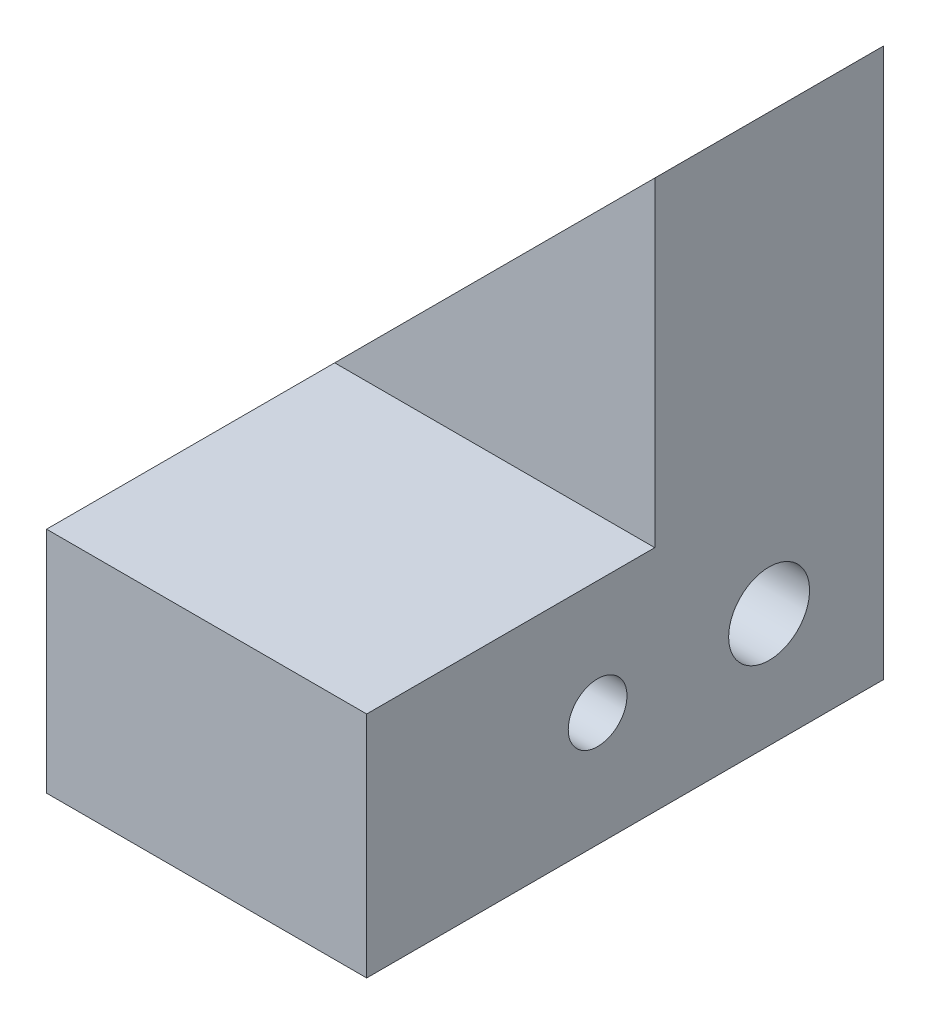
ISO-10303-21;
HEADER;
FILE_DESCRIPTION(('STEP AP214'),'2;1');
FILE_NAME('part.step','',(''),(''),'','','');
FILE_SCHEMA(('AUTOMOTIVE_DESIGN { 1 0 10303 214 1 1 1 1 }'));
ENDSEC;
DATA;
#1=APPLICATION_CONTEXT('core data for automotive mechanical design processes');
#2=APPLICATION_PROTOCOL_DEFINITION('international standard','automotive_design',2000,#1);
#3=PRODUCT_CONTEXT('',#1,'mechanical');
#4=PRODUCT('Part','Part','',(#3));
#5=PRODUCT_RELATED_PRODUCT_CATEGORY('part','',(#4));
#6=PRODUCT_DEFINITION_FORMATION('','',#4);
#7=PRODUCT_DEFINITION_CONTEXT('part definition',#1,'design');
#8=PRODUCT_DEFINITION('design','',#6,#7);
#9=PRODUCT_DEFINITION_SHAPE('','',#8);
#10=(LENGTH_UNIT() NAMED_UNIT(*) SI_UNIT(.MILLI.,.METRE.));
#11=(NAMED_UNIT(*) PLANE_ANGLE_UNIT() SI_UNIT($,.RADIAN.));
#12=(NAMED_UNIT(*) SI_UNIT($,.STERADIAN.) SOLID_ANGLE_UNIT());
#13=UNCERTAINTY_MEASURE_WITH_UNIT(LENGTH_MEASURE(1.E-05),#10,'distance_accuracy_value','');
#14=(GEOMETRIC_REPRESENTATION_CONTEXT(3) GLOBAL_UNCERTAINTY_ASSIGNED_CONTEXT((#13)) GLOBAL_UNIT_ASSIGNED_CONTEXT((#10,
#11,#12)) REPRESENTATION_CONTEXT('',''));
#15=CARTESIAN_POINT('',(0.,0.,0.));
#16=DIRECTION('',(0.,0.,1.));
#17=DIRECTION('',(1.,0.,0.));
#18=AXIS2_PLACEMENT_3D('',#15,#16,#17);
#19=CARTESIAN_POINT('',(-30.454816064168,30.48,-16.5538373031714));
#20=DIRECTION('',(1.,0.,0.));
#21=DIRECTION('',(0.,0.,-1.));
#22=AXIS2_PLACEMENT_3D('',#19,#20,#21);
#23=PLANE('',#22);
#24=CARTESIAN_POINT('',(-30.454816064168,6.35,-10.2038373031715));
#25=DIRECTION('',(-1.,0.,0.));
#26=DIRECTION('',(0.,0.,1.));
#27=AXIS2_PLACEMENT_3D('',#24,#25,#26);
#28=CIRCLE('',#27,2.2479);
#29=CARTESIAN_POINT('',(-30.454816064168,6.35,-7.95593730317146));
#30=VERTEX_POINT('',#29);
#31=EDGE_CURVE('E159',#30,#30,#28,.T.);
#32=ORIENTED_EDGE('',*,*,#31,.F.);
#33=EDGE_LOOP('',(#32));
#34=FACE_BOUND('',#33,.T.);
#35=CARTESIAN_POINT('',(-30.454816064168,6.35,-0.678837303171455));
#36=DIRECTION('',(-1.,0.,0.));
#37=DIRECTION('',(0.,0.,1.));
#38=AXIS2_PLACEMENT_3D('',#35,#36,#37);
#39=CIRCLE('',#38,1.63194999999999);
#40=CARTESIAN_POINT('',(-30.454816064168,6.35,0.953112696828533));
#41=VERTEX_POINT('',#40);
#42=EDGE_CURVE('E162',#41,#41,#39,.T.);
#43=ORIENTED_EDGE('',*,*,#42,.F.);
#44=EDGE_LOOP('',(#43));
#45=FACE_BOUND('',#44,.T.);
#46=DIRECTION('',(0.,0.,1.));
#47=VECTOR('',#46,1.);
#48=CARTESIAN_POINT('',(-30.454816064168,12.7,0.));
#49=LINE('',#48,#47);
#50=CARTESIAN_POINT('',(-30.454816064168,12.7,-3.85383730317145));
#51=VERTEX_POINT('',#50);
#52=CARTESIAN_POINT('',(-30.454816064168,12.7,12.1481626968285));
#53=VERTEX_POINT('',#52);
#54=EDGE_CURVE('E148',#51,#53,#49,.T.);
#55=ORIENTED_EDGE('',*,*,#54,.F.);
#56=DIRECTION('',(0.,0.,1.));
#57=VECTOR('',#56,1.);
#58=CARTESIAN_POINT('',(-30.454816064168,12.7,-34.3338373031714));
#59=LINE('',#58,#57);
#60=CARTESIAN_POINT('',(-30.454816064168,12.7,-16.5538373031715));
#61=VERTEX_POINT('',#60);
#62=EDGE_CURVE('E96',#61,#51,#59,.T.);
#63=ORIENTED_EDGE('',*,*,#62,.F.);
#64=DIRECTION('',(0.,-1.,0.));
#65=VECTOR('',#64,1.);
#66=CARTESIAN_POINT('',(-30.454816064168,30.48,-16.5538373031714));
#67=LINE('',#66,#65);
#68=CARTESIAN_POINT('',(-30.454816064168,0.,-16.5538373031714));
#69=VERTEX_POINT('',#68);
#70=EDGE_CURVE('E53',#61,#69,#67,.T.);
#71=ORIENTED_EDGE('',*,*,#70,.T.);
#72=DIRECTION('',(0.,0.,1.));
#73=VECTOR('',#72,1.);
#74=CARTESIAN_POINT('',(-30.454816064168,0.,-16.5538373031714));
#75=LINE('',#74,#73);
#76=CARTESIAN_POINT('',(-30.454816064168,0.,12.1481626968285));
#77=VERTEX_POINT('',#76);
#78=EDGE_CURVE('E108',#69,#77,#75,.T.);
#79=ORIENTED_EDGE('',*,*,#78,.T.);
#80=DIRECTION('',(0.,-1.,0.));
#81=VECTOR('',#80,1.);
#82=CARTESIAN_POINT('',(-30.454816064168,30.48,12.1481626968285));
#83=LINE('',#82,#81);
#84=EDGE_CURVE('E46',#53,#77,#83,.T.);
#85=ORIENTED_EDGE('',*,*,#84,.F.);
#86=EDGE_LOOP('',(#55,#63,#71,#79,#85));
#87=FACE_BOUND('',#86,.T.);
#88=ADVANCED_FACE('F38',(#34,#45,#87),#23,.F.);
#89=CARTESIAN_POINT('',(-12.674816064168,30.48,-16.5538373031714));
#90=DIRECTION('',(-1.,0.,0.));
#91=DIRECTION('',(0.,0.,1.));
#92=AXIS2_PLACEMENT_3D('',#89,#90,#91);
#93=PLANE('',#92);
#94=CARTESIAN_POINT('',(-12.674816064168,6.35,-10.2038373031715));
#95=DIRECTION('',(-1.,0.,0.));
#96=DIRECTION('',(0.,0.,1.));
#97=AXIS2_PLACEMENT_3D('',#94,#95,#96);
#98=CIRCLE('',#97,2.24789999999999);
#99=CARTESIAN_POINT('',(-12.674816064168,6.35,-7.95593730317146));
#100=VERTEX_POINT('',#99);
#101=EDGE_CURVE('E165',#100,#100,#98,.T.);
#102=ORIENTED_EDGE('',*,*,#101,.T.);
#103=EDGE_LOOP('',(#102));
#104=FACE_BOUND('',#103,.T.);
#105=CARTESIAN_POINT('',(-12.674816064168,6.35,-0.678837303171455));
#106=DIRECTION('',(-1.,0.,0.));
#107=DIRECTION('',(0.,0.,1.));
#108=AXIS2_PLACEMENT_3D('',#105,#106,#107);
#109=CIRCLE('',#108,1.63194999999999);
#110=CARTESIAN_POINT('',(-12.674816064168,6.35,0.953112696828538));
#111=VERTEX_POINT('',#110);
#112=EDGE_CURVE('E101',#111,#111,#109,.T.);
#113=ORIENTED_EDGE('',*,*,#112,.T.);
#114=EDGE_LOOP('',(#113));
#115=FACE_BOUND('',#114,.T.);
#116=DIRECTION('',(0.,1.,0.));
#117=VECTOR('',#116,1.);
#118=CARTESIAN_POINT('',(-12.674816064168,30.48,-3.85383730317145));
#119=LINE('',#118,#117);
#120=CARTESIAN_POINT('',(-12.674816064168,12.7,-3.85383730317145));
#121=VERTEX_POINT('',#120);
#122=CARTESIAN_POINT('',(-12.674816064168,30.48,-3.85383730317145));
#123=VERTEX_POINT('',#122);
#124=EDGE_CURVE('E104',#121,#123,#119,.T.);
#125=ORIENTED_EDGE('',*,*,#124,.F.);
#126=DIRECTION('',(0.,0.,1.));
#127=VECTOR('',#126,1.);
#128=CARTESIAN_POINT('',(-12.674816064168,12.7,-16.5538373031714));
#129=LINE('',#128,#127);
#130=CARTESIAN_POINT('',(-12.674816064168,12.7,12.1481626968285));
#131=VERTEX_POINT('',#130);
#132=EDGE_CURVE('E11',#121,#131,#129,.T.);
#133=ORIENTED_EDGE('',*,*,#132,.T.);
#134=DIRECTION('',(0.,-1.,0.));
#135=VECTOR('',#134,1.);
#136=CARTESIAN_POINT('',(-12.674816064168,30.48,12.1481626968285));
#137=LINE('',#136,#135);
#138=CARTESIAN_POINT('',(-12.674816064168,0.,12.1481626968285));
#139=VERTEX_POINT('',#138);
#140=EDGE_CURVE('E133',#131,#139,#137,.T.);
#141=ORIENTED_EDGE('',*,*,#140,.T.);
#142=DIRECTION('',(0.,0.,-1.));
#143=VECTOR('',#142,1.);
#144=CARTESIAN_POINT('',(-12.674816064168,0.,-16.5538373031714));
#145=LINE('',#144,#143);
#146=CARTESIAN_POINT('',(-12.674816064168,0.,-16.5538373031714));
#147=VERTEX_POINT('',#146);
#148=EDGE_CURVE('E61',#139,#147,#145,.T.);
#149=ORIENTED_EDGE('',*,*,#148,.T.);
#150=DIRECTION('',(0.,-1.,0.));
#151=VECTOR('',#150,1.);
#152=CARTESIAN_POINT('',(-12.674816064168,30.48,-16.5538373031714));
#153=LINE('',#152,#151);
#154=CARTESIAN_POINT('',(-12.674816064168,30.48,-16.5538373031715));
#155=VERTEX_POINT('',#154);
#156=EDGE_CURVE('E112',#155,#147,#153,.T.);
#157=ORIENTED_EDGE('',*,*,#156,.F.);
#158=DIRECTION('',(0.,0.,-1.));
#159=VECTOR('',#158,1.);
#160=CARTESIAN_POINT('',(-12.674816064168,30.48,-16.5538373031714));
#161=LINE('',#160,#159);
#162=EDGE_CURVE('E94',#123,#155,#161,.T.);
#163=ORIENTED_EDGE('',*,*,#162,.F.);
#164=EDGE_LOOP('',(#125,#133,#141,#149,#157,#163));
#165=FACE_BOUND('',#164,.T.);
#166=ADVANCED_FACE('F111',(#104,#115,#165),#93,.F.);
#167=CARTESIAN_POINT('',(-30.454816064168,30.48,12.1481626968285));
#168=DIRECTION('',(0.,0.,-1.));
#169=DIRECTION('',(-1.,0.,0.));
#170=AXIS2_PLACEMENT_3D('',#167,#168,#169);
#171=PLANE('',#170);
#172=ORIENTED_EDGE('',*,*,#140,.F.);
#173=DIRECTION('',(-1.,0.,0.));
#174=VECTOR('',#173,1.);
#175=CARTESIAN_POINT('',(0.0251839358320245,12.7,12.1481626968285));
#176=LINE('',#175,#174);
#177=EDGE_CURVE('E109',#131,#53,#176,.T.);
#178=ORIENTED_EDGE('',*,*,#177,.T.);
#179=ORIENTED_EDGE('',*,*,#84,.T.);
#180=DIRECTION('',(1.,0.,0.));
#181=VECTOR('',#180,1.);
#182=CARTESIAN_POINT('',(-30.454816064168,0.,12.1481626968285));
#183=LINE('',#182,#181);
#184=EDGE_CURVE('E125',#77,#139,#183,.T.);
#185=ORIENTED_EDGE('',*,*,#184,.T.);
#186=EDGE_LOOP('',(#172,#178,#179,#185));
#187=FACE_BOUND('',#186,.T.);
#188=ADVANCED_FACE('F142',(#187),#171,.F.);
#189=CARTESIAN_POINT('',(-30.454816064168,30.48,-16.5538373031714));
#190=DIRECTION('',(0.,0.,1.));
#191=DIRECTION('',(1.,0.,0.));
#192=AXIS2_PLACEMENT_3D('',#189,#190,#191);
#193=PLANE('',#192);
#194=ORIENTED_EDGE('',*,*,#70,.F.);
#195=DIRECTION('',(0.707106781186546,0.707106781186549,0.));
#196=VECTOR('',#195,1.);
#197=CARTESIAN_POINT('',(-21.564816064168,21.59,-16.5538373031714));
#198=LINE('',#197,#196);
#199=EDGE_CURVE('E178',#61,#155,#198,.T.);
#200=ORIENTED_EDGE('',*,*,#199,.T.);
#201=ORIENTED_EDGE('',*,*,#156,.T.);
#202=DIRECTION('',(-1.,0.,0.));
#203=VECTOR('',#202,1.);
#204=CARTESIAN_POINT('',(-30.454816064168,0.,-16.5538373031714));
#205=LINE('',#204,#203);
#206=EDGE_CURVE('E114',#147,#69,#205,.T.);
#207=ORIENTED_EDGE('',*,*,#206,.T.);
#208=EDGE_LOOP('',(#194,#200,#201,#207));
#209=FACE_BOUND('',#208,.T.);
#210=ADVANCED_FACE('F195',(#209),#193,.F.);
#211=CARTESIAN_POINT('',(0.,0.,0.));
#212=DIRECTION('',(0.,1.,0.));
#213=DIRECTION('',(0.,0.,1.));
#214=AXIS2_PLACEMENT_3D('',#211,#212,#213);
#215=PLANE('',#214);
#216=ORIENTED_EDGE('',*,*,#78,.F.);
#217=ORIENTED_EDGE('',*,*,#206,.F.);
#218=ORIENTED_EDGE('',*,*,#148,.F.);
#219=ORIENTED_EDGE('',*,*,#184,.F.);
#220=EDGE_LOOP('',(#216,#217,#218,#219));
#221=FACE_BOUND('',#220,.T.);
#222=ADVANCED_FACE('F146',(#221),#215,.F.);
#223=CARTESIAN_POINT('',(0.0251839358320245,12.7,0.));
#224=DIRECTION('',(0.,-1.,0.));
#225=DIRECTION('',(0.,0.,-1.));
#226=AXIS2_PLACEMENT_3D('',#223,#224,#225);
#227=PLANE('',#226);
#228=DIRECTION('',(-1.,0.,0.));
#229=VECTOR('',#228,1.);
#230=CARTESIAN_POINT('',(0.0251839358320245,12.7,-3.85383730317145));
#231=LINE('',#230,#229);
#232=EDGE_CURVE('E106',#121,#51,#231,.T.);
#233=ORIENTED_EDGE('',*,*,#232,.T.);
#234=ORIENTED_EDGE('',*,*,#54,.T.);
#235=ORIENTED_EDGE('',*,*,#177,.F.);
#236=ORIENTED_EDGE('',*,*,#132,.F.);
#237=EDGE_LOOP('',(#233,#234,#235,#236));
#238=FACE_BOUND('',#237,.T.);
#239=ADVANCED_FACE('F187',(#238),#227,.F.);
#240=CARTESIAN_POINT('',(0.0251839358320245,0.,-3.85383730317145));
#241=DIRECTION('',(0.,0.,1.));
#242=DIRECTION('',(1.,0.,0.));
#243=AXIS2_PLACEMENT_3D('',#240,#241,#242);
#244=PLANE('',#243);
#245=DIRECTION('',(0.707106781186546,0.707106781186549,0.));
#246=VECTOR('',#245,1.);
#247=CARTESIAN_POINT('',(-21.577408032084,21.577408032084,-3.85383730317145));
#248=LINE('',#247,#246);
#249=EDGE_CURVE('E90',#51,#123,#248,.T.);
#250=ORIENTED_EDGE('',*,*,#249,.F.);
#251=ORIENTED_EDGE('',*,*,#232,.F.);
#252=ORIENTED_EDGE('',*,*,#124,.T.);
#253=EDGE_LOOP('',(#250,#251,#252));
#254=FACE_BOUND('',#253,.T.);
#255=ADVANCED_FACE('F105',(#254),#244,.T.);
#256=CARTESIAN_POINT('',(-21.577408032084,21.577408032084,-34.3338373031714));
#257=DIRECTION('',(0.707106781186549,-0.707106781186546,0.));
#258=DIRECTION('',(0.707106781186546,0.707106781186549,0.));
#259=AXIS2_PLACEMENT_3D('',#256,#257,#258);
#260=PLANE('',#259);
#261=ORIENTED_EDGE('',*,*,#62,.T.);
#262=ORIENTED_EDGE('',*,*,#249,.T.);
#263=ORIENTED_EDGE('',*,*,#162,.T.);
#264=ORIENTED_EDGE('',*,*,#199,.F.);
#265=EDGE_LOOP('',(#261,#262,#263,#264));
#266=FACE_BOUND('',#265,.T.);
#267=ADVANCED_FACE('F92',(#266),#260,.F.);
#268=CARTESIAN_POINT('',(-30.454816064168,6.35,-0.678837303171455));
#269=DIRECTION('',(-1.,0.,0.));
#270=DIRECTION('',(0.,0.,1.));
#271=AXIS2_PLACEMENT_3D('',#268,#269,#270);
#272=CYLINDRICAL_SURFACE('',#271,1.63194999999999);
#273=ORIENTED_EDGE('',*,*,#112,.F.);
#274=EDGE_LOOP('',(#273));
#275=FACE_BOUND('',#274,.T.);
#276=ORIENTED_EDGE('',*,*,#42,.T.);
#277=EDGE_LOOP('',(#276));
#278=FACE_BOUND('',#277,.T.);
#279=ADVANCED_FACE('F254',(#275,#278),#272,.F.);
#280=CARTESIAN_POINT('',(-30.454816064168,6.35,-10.2038373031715));
#281=DIRECTION('',(-1.,0.,0.));
#282=DIRECTION('',(0.,0.,1.));
#283=AXIS2_PLACEMENT_3D('',#280,#281,#282);
#284=CYLINDRICAL_SURFACE('',#283,2.24789999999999);
#285=ORIENTED_EDGE('',*,*,#101,.F.);
#286=EDGE_LOOP('',(#285));
#287=FACE_BOUND('',#286,.T.);
#288=ORIENTED_EDGE('',*,*,#31,.T.);
#289=EDGE_LOOP('',(#288));
#290=FACE_BOUND('',#289,.T.);
#291=ADVANCED_FACE('F263',(#287,#290),#284,.F.);
#292=CLOSED_SHELL('',(#88,#166,#188,#210,#222,#239,#255,#267,#279,#291));
#293=MANIFOLD_SOLID_BREP('B2',#292);
#294=ADVANCED_BREP_SHAPE_REPRESENTATION('',(#18,#293),#14);
#295=SHAPE_DEFINITION_REPRESENTATION(#9,#294);
ENDSEC;
END-ISO-10303-21;
